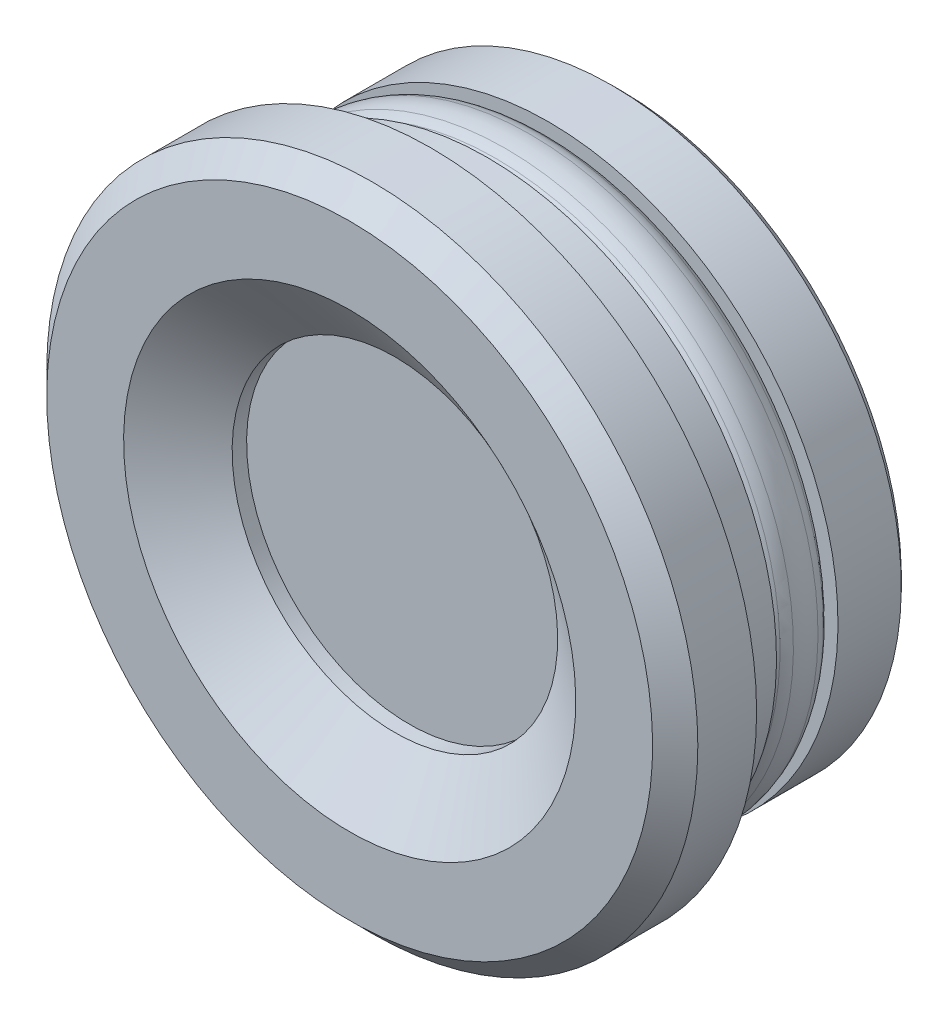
ISO-10303-21;
HEADER;
FILE_DESCRIPTION(('STEP AP214'),'2;1');
FILE_NAME('part.step','',(''),(''),'','','');
FILE_SCHEMA(('AUTOMOTIVE_DESIGN { 1 0 10303 214 1 1 1 1 }'));
ENDSEC;
DATA;
#1=APPLICATION_CONTEXT('core data for automotive mechanical design processes');
#2=APPLICATION_PROTOCOL_DEFINITION('international standard','automotive_design',2000,#1);
#3=PRODUCT_CONTEXT('',#1,'mechanical');
#4=PRODUCT('Part','Part','',(#3));
#5=PRODUCT_RELATED_PRODUCT_CATEGORY('part','',(#4));
#6=PRODUCT_DEFINITION_FORMATION('','',#4);
#7=PRODUCT_DEFINITION_CONTEXT('part definition',#1,'design');
#8=PRODUCT_DEFINITION('design','',#6,#7);
#9=PRODUCT_DEFINITION_SHAPE('','',#8);
#10=(LENGTH_UNIT() NAMED_UNIT(*) SI_UNIT(.MILLI.,.METRE.));
#11=(NAMED_UNIT(*) PLANE_ANGLE_UNIT() SI_UNIT($,.RADIAN.));
#12=(NAMED_UNIT(*) SI_UNIT($,.STERADIAN.) SOLID_ANGLE_UNIT());
#13=UNCERTAINTY_MEASURE_WITH_UNIT(LENGTH_MEASURE(1.E-05),#10,'distance_accuracy_value','');
#14=(GEOMETRIC_REPRESENTATION_CONTEXT(3) GLOBAL_UNCERTAINTY_ASSIGNED_CONTEXT((#13)) GLOBAL_UNIT_ASSIGNED_CONTEXT((#10,
#11,#12)) REPRESENTATION_CONTEXT('',''));
#15=CARTESIAN_POINT('',(0.,0.,0.));
#16=DIRECTION('',(0.,0.,1.));
#17=DIRECTION('',(1.,0.,0.));
#18=AXIS2_PLACEMENT_3D('',#15,#16,#17);
#19=CARTESIAN_POINT('',(0.,0.,-10.5000000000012));
#20=DIRECTION('',(0.,0.,-1.));
#21=DIRECTION('',(0.,1.,0.));
#22=AXIS2_PLACEMENT_3D('',#19,#20,#21);
#23=PLANE('',#22);
#24=CARTESIAN_POINT('',(0.,0.,-10.5000000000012));
#25=DIRECTION('',(0.,0.,-1.));
#26=DIRECTION('',(0.,1.,0.));
#27=AXIS2_PLACEMENT_3D('',#24,#25,#26);
#28=CIRCLE('',#27,15.5);
#29=CARTESIAN_POINT('',(0.,15.5,-10.5000000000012));
#30=VERTEX_POINT('',#29);
#31=EDGE_CURVE('E8',#30,#30,#28,.T.);
#32=ORIENTED_EDGE('',*,*,#31,.T.);
#33=EDGE_LOOP('',(#32));
#34=FACE_BOUND('',#33,.T.);
#35=ADVANCED_FACE('F12',(#34),#23,.T.);
#36=CARTESIAN_POINT('',(0.,0.,-10.5000000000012));
#37=DIRECTION('',(0.,0.,1.));
#38=DIRECTION('',(0.,-1.,0.));
#39=AXIS2_PLACEMENT_3D('',#36,#37,#38);
#40=CONICAL_SURFACE('',#39,15.5,0.785398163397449);
#41=CARTESIAN_POINT('',(0.,0.,-10.0000000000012));
#42=DIRECTION('',(0.,0.,-1.));
#43=DIRECTION('',(0.,1.,0.));
#44=AXIS2_PLACEMENT_3D('',#41,#42,#43);
#45=CIRCLE('',#44,16.);
#46=CARTESIAN_POINT('',(0.,16.,-10.0000000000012));
#47=VERTEX_POINT('',#46);
#48=EDGE_CURVE('E18',#47,#47,#45,.T.);
#49=ORIENTED_EDGE('',*,*,#48,.T.);
#50=EDGE_LOOP('',(#49));
#51=FACE_BOUND('',#50,.T.);
#52=ORIENTED_EDGE('',*,*,#31,.F.);
#53=EDGE_LOOP('',(#52));
#54=FACE_BOUND('',#53,.T.);
#55=ADVANCED_FACE('F91',(#51,#54),#40,.T.);
#56=CARTESIAN_POINT('',(0.,0.,-10.5000000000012));
#57=DIRECTION('',(0.,0.,-1.));
#58=DIRECTION('',(0.,1.,0.));
#59=AXIS2_PLACEMENT_3D('',#56,#57,#58);
#60=CYLINDRICAL_SURFACE('',#59,16.);
#61=CARTESIAN_POINT('',(0.,0.,-6.50000000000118));
#62=DIRECTION('',(0.,0.,-1.));
#63=DIRECTION('',(0.,1.,0.));
#64=AXIS2_PLACEMENT_3D('',#61,#62,#63);
#65=CIRCLE('',#64,16.);
#66=CARTESIAN_POINT('',(0.,16.,-6.50000000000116));
#67=VERTEX_POINT('',#66);
#68=EDGE_CURVE('E22',#67,#67,#65,.T.);
#69=ORIENTED_EDGE('',*,*,#68,.T.);
#70=EDGE_LOOP('',(#69));
#71=FACE_BOUND('',#70,.T.);
#72=ORIENTED_EDGE('',*,*,#48,.F.);
#73=EDGE_LOOP('',(#72));
#74=FACE_BOUND('',#73,.T.);
#75=ADVANCED_FACE('F96',(#71,#74),#60,.T.);
#76=CARTESIAN_POINT('',(0.,14.9500000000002,-6.50000000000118));
#77=DIRECTION('',(0.,0.,1.));
#78=DIRECTION('',(0.,-1.,0.));
#79=AXIS2_PLACEMENT_3D('',#76,#77,#78);
#80=PLANE('',#79);
#81=CARTESIAN_POINT('',(0.,0.,-6.50000000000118));
#82=DIRECTION('',(0.,0.,-1.));
#83=DIRECTION('',(0.,1.,0.));
#84=AXIS2_PLACEMENT_3D('',#81,#82,#83);
#85=CIRCLE('',#84,14.9500000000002);
#86=CARTESIAN_POINT('',(0.,14.9500000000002,-6.50000000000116));
#87=VERTEX_POINT('',#86);
#88=EDGE_CURVE('E26',#87,#87,#85,.T.);
#89=ORIENTED_EDGE('',*,*,#88,.T.);
#90=EDGE_LOOP('',(#89));
#91=FACE_BOUND('',#90,.T.);
#92=ORIENTED_EDGE('',*,*,#68,.F.);
#93=EDGE_LOOP('',(#92));
#94=FACE_BOUND('',#93,.T.);
#95=ADVANCED_FACE('F101',(#91,#94),#80,.T.);
#96=CARTESIAN_POINT('',(0.,0.,-5.83242233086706));
#97=DIRECTION('',(0.,0.,-1.));
#98=DIRECTION('',(0.,1.,0.));
#99=AXIS2_PLACEMENT_3D('',#96,#97,#98);
#100=TOROIDAL_SURFACE('',#99,14.9500000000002,0.667577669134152);
#101=CARTESIAN_POINT('',(0.,0.,-6.3868638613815));
#102=DIRECTION('',(0.,0.,-1.));
#103=DIRECTION('',(0.,1.,0.));
#104=AXIS2_PLACEMENT_3D('',#101,#102,#103);
#105=CIRCLE('',#104,15.3218259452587);
#106=CARTESIAN_POINT('',(0.,15.3218259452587,-6.38686386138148));
#107=VERTEX_POINT('',#106);
#108=EDGE_CURVE('E31',#107,#107,#105,.T.);
#109=ORIENTED_EDGE('',*,*,#108,.T.);
#110=EDGE_LOOP('',(#109));
#111=FACE_BOUND('',#110,.T.);
#112=ORIENTED_EDGE('',*,*,#88,.F.);
#113=EDGE_LOOP('',(#112));
#114=FACE_BOUND('',#113,.T.);
#115=ADVANCED_FACE('F108',(#111,#114),#100,.T.);
#116=CARTESIAN_POINT('',(0.,0.,-5.33920444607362));
#117=DIRECTION('',(0.,0.,-1.));
#118=DIRECTION('',(0.,1.,0.));
#119=AXIS2_PLACEMENT_3D('',#116,#117,#118);
#120=TOROIDAL_SURFACE('',#119,14.6192325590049,1.26143874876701);
#121=CARTESIAN_POINT('',(0.,0.,-6.00208152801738));
#122=DIRECTION('',(0.,0.,-1.));
#123=DIRECTION('',(0.,1.,0.));
#124=AXIS2_PLACEMENT_3D('',#121,#122,#123);
#125=CIRCLE('',#124,15.6924621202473);
#126=CARTESIAN_POINT('',(0.,15.6924621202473,-6.00208152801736));
#127=VERTEX_POINT('',#126);
#128=EDGE_CURVE('E34',#127,#127,#125,.T.);
#129=ORIENTED_EDGE('',*,*,#128,.T.);
#130=EDGE_LOOP('',(#129));
#131=FACE_BOUND('',#130,.T.);
#132=ORIENTED_EDGE('',*,*,#108,.F.);
#133=EDGE_LOOP('',(#132));
#134=FACE_BOUND('',#133,.T.);
#135=ADVANCED_FACE('F112',(#131,#134),#120,.T.);
#136=CARTESIAN_POINT('',(0.,0.,-5.013662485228));
#137=DIRECTION('',(0.,0.,-1.));
#138=DIRECTION('',(0.,1.,0.));
#139=AXIS2_PLACEMENT_3D('',#136,#137,#138);
#140=TOROIDAL_SURFACE('',#139,14.0921646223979,1.88093707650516);
#141=CARTESIAN_POINT('',(0.,0.,-5.47986199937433));
#142=DIRECTION('',(0.,0.,-1.));
#143=DIRECTION('',(0.,1.,0.));
#144=AXIS2_PLACEMENT_3D('',#141,#142,#143);
#145=CIRCLE('',#144,15.914411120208);
#146=CARTESIAN_POINT('',(0.,15.9144111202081,-5.47986199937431));
#147=VERTEX_POINT('',#146);
#148=EDGE_CURVE('E37',#147,#147,#145,.T.);
#149=ORIENTED_EDGE('',*,*,#148,.T.);
#150=EDGE_LOOP('',(#149));
#151=FACE_BOUND('',#150,.T.);
#152=ORIENTED_EDGE('',*,*,#128,.F.);
#153=EDGE_LOOP('',(#152));
#154=FACE_BOUND('',#153,.T.);
#155=ADVANCED_FACE('F116',(#151,#154),#140,.T.);
#156=CARTESIAN_POINT('',(0.,0.,-4.80000000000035));
#157=DIRECTION('',(0.,0.,-1.));
#158=DIRECTION('',(0.,1.,0.));
#159=AXIS2_PLACEMENT_3D('',#156,#157,#158);
#160=TOROIDAL_SURFACE('',#159,13.2570163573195,2.74298364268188);
#161=CARTESIAN_POINT('',(0.,0.,-4.12013800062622));
#162=DIRECTION('',(0.,0.,-1.));
#163=DIRECTION('',(0.,1.,0.));
#164=AXIS2_PLACEMENT_3D('',#161,#162,#163);
#165=CIRCLE('',#164,15.914411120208);
#166=CARTESIAN_POINT('',(0.,15.9144111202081,-4.1201380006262));
#167=VERTEX_POINT('',#166);
#168=EDGE_CURVE('E40',#167,#167,#165,.T.);
#169=ORIENTED_EDGE('',*,*,#168,.T.);
#170=EDGE_LOOP('',(#169));
#171=FACE_BOUND('',#170,.T.);
#172=ORIENTED_EDGE('',*,*,#148,.F.);
#173=EDGE_LOOP('',(#172));
#174=FACE_BOUND('',#173,.T.);
#175=ADVANCED_FACE('F120',(#171,#174),#160,.T.);
#176=CARTESIAN_POINT('',(0.,0.,-4.58633751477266));
#177=DIRECTION('',(0.,0.,-1.));
#178=DIRECTION('',(0.,1.,0.));
#179=AXIS2_PLACEMENT_3D('',#176,#177,#178);
#180=TOROIDAL_SURFACE('',#179,14.0921646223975,1.88093707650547);
#181=CARTESIAN_POINT('',(0.,0.,-3.59791847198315));
#182=DIRECTION('',(0.,0.,-1.));
#183=DIRECTION('',(0.,1.,0.));
#184=AXIS2_PLACEMENT_3D('',#181,#182,#183);
#185=CIRCLE('',#184,15.6924621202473);
#186=CARTESIAN_POINT('',(0.,15.6924621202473,-3.59791847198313));
#187=VERTEX_POINT('',#186);
#188=EDGE_CURVE('E43',#187,#187,#185,.T.);
#189=ORIENTED_EDGE('',*,*,#188,.T.);
#190=EDGE_LOOP('',(#189));
#191=FACE_BOUND('',#190,.T.);
#192=ORIENTED_EDGE('',*,*,#168,.F.);
#193=EDGE_LOOP('',(#192));
#194=FACE_BOUND('',#193,.T.);
#195=ADVANCED_FACE('F124',(#191,#194),#180,.T.);
#196=CARTESIAN_POINT('',(0.,0.,-4.26079555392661));
#197=DIRECTION('',(0.,0.,-1.));
#198=DIRECTION('',(0.,1.,0.));
#199=AXIS2_PLACEMENT_3D('',#196,#197,#198);
#200=TOROIDAL_SURFACE('',#199,14.6192325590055,1.26143874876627);
#201=CARTESIAN_POINT('',(0.,0.,-3.21313613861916));
#202=DIRECTION('',(0.,0.,-1.));
#203=DIRECTION('',(0.,1.,0.));
#204=AXIS2_PLACEMENT_3D('',#201,#202,#203);
#205=CIRCLE('',#204,15.3218259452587);
#206=CARTESIAN_POINT('',(0.,15.3218259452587,-3.21313613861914));
#207=VERTEX_POINT('',#206);
#208=EDGE_CURVE('E46',#207,#207,#205,.T.);
#209=ORIENTED_EDGE('',*,*,#208,.T.);
#210=EDGE_LOOP('',(#209));
#211=FACE_BOUND('',#210,.T.);
#212=ORIENTED_EDGE('',*,*,#188,.F.);
#213=EDGE_LOOP('',(#212));
#214=FACE_BOUND('',#213,.T.);
#215=ADVANCED_FACE('F128',(#211,#214),#200,.T.);
#216=CARTESIAN_POINT('',(0.,0.,-3.7675776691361));
#217=DIRECTION('',(0.,0.,-1.));
#218=DIRECTION('',(0.,1.,0.));
#219=AXIS2_PLACEMENT_3D('',#216,#217,#218);
#220=TOROIDAL_SURFACE('',#219,14.9500000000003,0.667577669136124);
#221=CARTESIAN_POINT('',(0.,0.,-3.1));
#222=DIRECTION('',(0.,0.,-1.));
#223=DIRECTION('',(0.,1.,0.));
#224=AXIS2_PLACEMENT_3D('',#221,#222,#223);
#225=CIRCLE('',#224,14.9500000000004);
#226=CARTESIAN_POINT('',(0.,14.9500000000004,-3.09999999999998));
#227=VERTEX_POINT('',#226);
#228=EDGE_CURVE('E49',#227,#227,#225,.T.);
#229=ORIENTED_EDGE('',*,*,#228,.T.);
#230=EDGE_LOOP('',(#229));
#231=FACE_BOUND('',#230,.T.);
#232=ORIENTED_EDGE('',*,*,#208,.F.);
#233=EDGE_LOOP('',(#232));
#234=FACE_BOUND('',#233,.T.);
#235=ADVANCED_FACE('F132',(#231,#234),#220,.T.);
#236=CARTESIAN_POINT('',(0.,14.9500000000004,-3.09999999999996));
#237=DIRECTION('',(0.,0.,-1.));
#238=DIRECTION('',(0.,1.,0.));
#239=AXIS2_PLACEMENT_3D('',#236,#237,#238);
#240=PLANE('',#239);
#241=CARTESIAN_POINT('',(0.,0.,-3.1));
#242=DIRECTION('',(0.,0.,-1.));
#243=DIRECTION('',(0.,1.,0.));
#244=AXIS2_PLACEMENT_3D('',#241,#242,#243);
#245=CIRCLE('',#244,16.0000000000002);
#246=CARTESIAN_POINT('',(0.,16.0000000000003,-3.09999999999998));
#247=VERTEX_POINT('',#246);
#248=EDGE_CURVE('E52',#247,#247,#245,.T.);
#249=ORIENTED_EDGE('',*,*,#248,.T.);
#250=EDGE_LOOP('',(#249));
#251=FACE_BOUND('',#250,.T.);
#252=ORIENTED_EDGE('',*,*,#228,.F.);
#253=EDGE_LOOP('',(#252));
#254=FACE_BOUND('',#253,.T.);
#255=ADVANCED_FACE('F136',(#251,#254),#240,.T.);
#256=CARTESIAN_POINT('',(0.,0.,-10.5000000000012));
#257=DIRECTION('',(0.,0.,-1.));
#258=DIRECTION('',(0.,1.,0.));
#259=AXIS2_PLACEMENT_3D('',#256,#257,#258);
#260=CYLINDRICAL_SURFACE('',#259,16.0000000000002);
#261=CARTESIAN_POINT('',(0.,0.,0.));
#262=DIRECTION('',(0.,0.,-1.));
#263=DIRECTION('',(0.,1.,0.));
#264=AXIS2_PLACEMENT_3D('',#261,#262,#263);
#265=CIRCLE('',#264,16.0000000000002);
#266=CARTESIAN_POINT('',(0.,16.0000000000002,0.));
#267=VERTEX_POINT('',#266);
#268=EDGE_CURVE('E55',#267,#267,#265,.T.);
#269=ORIENTED_EDGE('',*,*,#268,.T.);
#270=EDGE_LOOP('',(#269));
#271=FACE_BOUND('',#270,.T.);
#272=ORIENTED_EDGE('',*,*,#248,.F.);
#273=EDGE_LOOP('',(#272));
#274=FACE_BOUND('',#273,.T.);
#275=ADVANCED_FACE('F140',(#271,#274),#260,.T.);
#276=CARTESIAN_POINT('',(0.,16.,0.));
#277=DIRECTION('',(0.,0.,-1.));
#278=DIRECTION('',(0.,1.,0.));
#279=AXIS2_PLACEMENT_3D('',#276,#277,#278);
#280=PLANE('',#279);
#281=CARTESIAN_POINT('',(0.,0.,0.));
#282=DIRECTION('',(0.,0.,-1.));
#283=DIRECTION('',(0.,1.,0.));
#284=AXIS2_PLACEMENT_3D('',#281,#282,#283);
#285=CIRCLE('',#284,18.);
#286=CARTESIAN_POINT('',(0.,18.,0.));
#287=VERTEX_POINT('',#286);
#288=EDGE_CURVE('E58',#287,#287,#285,.T.);
#289=ORIENTED_EDGE('',*,*,#288,.T.);
#290=EDGE_LOOP('',(#289));
#291=FACE_BOUND('',#290,.T.);
#292=ORIENTED_EDGE('',*,*,#268,.F.);
#293=EDGE_LOOP('',(#292));
#294=FACE_BOUND('',#293,.T.);
#295=ADVANCED_FACE('F144',(#291,#294),#280,.T.);
#296=CARTESIAN_POINT('',(0.,0.,-10.5000000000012));
#297=DIRECTION('',(0.,0.,-1.));
#298=DIRECTION('',(0.,1.,0.));
#299=AXIS2_PLACEMENT_3D('',#296,#297,#298);
#300=CYLINDRICAL_SURFACE('',#299,18.);
#301=CARTESIAN_POINT('',(0.,0.,3.25));
#302=DIRECTION('',(0.,0.,-1.));
#303=DIRECTION('',(0.,1.,0.));
#304=AXIS2_PLACEMENT_3D('',#301,#302,#303);
#305=CIRCLE('',#304,18.);
#306=CARTESIAN_POINT('',(0.,18.,3.25000000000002));
#307=VERTEX_POINT('',#306);
#308=EDGE_CURVE('E61',#307,#307,#305,.T.);
#309=ORIENTED_EDGE('',*,*,#308,.T.);
#310=EDGE_LOOP('',(#309));
#311=FACE_BOUND('',#310,.T.);
#312=ORIENTED_EDGE('',*,*,#288,.F.);
#313=EDGE_LOOP('',(#312));
#314=FACE_BOUND('',#313,.T.);
#315=ADVANCED_FACE('F148',(#311,#314),#300,.T.);
#316=CARTESIAN_POINT('',(0.,0.,3.25));
#317=DIRECTION('',(0.,0.,-1.));
#318=DIRECTION('',(0.,1.,0.));
#319=AXIS2_PLACEMENT_3D('',#316,#317,#318);
#320=CONICAL_SURFACE('',#319,18.,0.785398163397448);
#321=CARTESIAN_POINT('',(0.,0.,4.5));
#322=DIRECTION('',(0.,0.,-1.));
#323=DIRECTION('',(0.,1.,0.));
#324=AXIS2_PLACEMENT_3D('',#321,#322,#323);
#325=CIRCLE('',#324,16.75);
#326=CARTESIAN_POINT('',(0.,16.75,4.50000000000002));
#327=VERTEX_POINT('',#326);
#328=EDGE_CURVE('E64',#327,#327,#325,.T.);
#329=ORIENTED_EDGE('',*,*,#328,.T.);
#330=EDGE_LOOP('',(#329));
#331=FACE_BOUND('',#330,.T.);
#332=ORIENTED_EDGE('',*,*,#308,.F.);
#333=EDGE_LOOP('',(#332));
#334=FACE_BOUND('',#333,.T.);
#335=ADVANCED_FACE('F152',(#331,#334),#320,.T.);
#336=CARTESIAN_POINT('',(0.,12.5,4.5));
#337=DIRECTION('',(0.,0.,1.));
#338=DIRECTION('',(0.,-1.,0.));
#339=AXIS2_PLACEMENT_3D('',#336,#337,#338);
#340=PLANE('',#339);
#341=CARTESIAN_POINT('',(0.,0.,4.5));
#342=DIRECTION('',(0.,0.,-1.));
#343=DIRECTION('',(0.,1.,0.));
#344=AXIS2_PLACEMENT_3D('',#341,#342,#343);
#345=CIRCLE('',#344,12.5);
#346=CARTESIAN_POINT('',(0.,12.5,4.50000000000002));
#347=VERTEX_POINT('',#346);
#348=EDGE_CURVE('E67',#347,#347,#345,.T.);
#349=ORIENTED_EDGE('',*,*,#348,.T.);
#350=EDGE_LOOP('',(#349));
#351=FACE_BOUND('',#350,.T.);
#352=ORIENTED_EDGE('',*,*,#328,.F.);
#353=EDGE_LOOP('',(#352));
#354=FACE_BOUND('',#353,.T.);
#355=ADVANCED_FACE('F156',(#351,#354),#340,.T.);
#356=CARTESIAN_POINT('',(0.,0.,4.5));
#357=DIRECTION('',(0.,0.,1.));
#358=DIRECTION('',(0.,-1.,0.));
#359=AXIS2_PLACEMENT_3D('',#356,#357,#358);
#360=CONICAL_SURFACE('',#359,12.5,0.950546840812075);
#361=CARTESIAN_POINT('',(0.,0.,2.));
#362=DIRECTION('',(0.,0.,-1.));
#363=DIRECTION('',(0.,1.,0.));
#364=AXIS2_PLACEMENT_3D('',#361,#362,#363);
#365=CIRCLE('',#364,9.);
#366=CARTESIAN_POINT('',(0.,9.,2.00000000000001));
#367=VERTEX_POINT('',#366);
#368=EDGE_CURVE('E70',#367,#367,#365,.T.);
#369=ORIENTED_EDGE('',*,*,#368,.T.);
#370=EDGE_LOOP('',(#369));
#371=FACE_BOUND('',#370,.T.);
#372=ORIENTED_EDGE('',*,*,#348,.F.);
#373=EDGE_LOOP('',(#372));
#374=FACE_BOUND('',#373,.T.);
#375=ADVANCED_FACE('F88',(#371,#374),#360,.F.);
#376=CARTESIAN_POINT('',(0.,0.,-10.5000000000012));
#377=DIRECTION('',(0.,0.,-1.));
#378=DIRECTION('',(0.,1.,0.));
#379=AXIS2_PLACEMENT_3D('',#376,#377,#378);
#380=CYLINDRICAL_SURFACE('',#379,9.);
#381=CARTESIAN_POINT('',(0.,0.,1.2));
#382=DIRECTION('',(0.,0.,-1.));
#383=DIRECTION('',(0.,1.,0.));
#384=AXIS2_PLACEMENT_3D('',#381,#382,#383);
#385=CIRCLE('',#384,9.);
#386=CARTESIAN_POINT('',(0.,9.,1.20000000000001));
#387=VERTEX_POINT('',#386);
#388=EDGE_CURVE('E73',#387,#387,#385,.T.);
#389=ORIENTED_EDGE('',*,*,#388,.T.);
#390=EDGE_LOOP('',(#389));
#391=FACE_BOUND('',#390,.T.);
#392=ORIENTED_EDGE('',*,*,#368,.F.);
#393=EDGE_LOOP('',(#392));
#394=FACE_BOUND('',#393,.T.);
#395=ADVANCED_FACE('F77',(#391,#394),#380,.F.);
#396=CARTESIAN_POINT('',(0.,0.,1.20000000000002));
#397=DIRECTION('',(0.,0.,1.));
#398=DIRECTION('',(0.,-1.,0.));
#399=AXIS2_PLACEMENT_3D('',#396,#397,#398);
#400=PLANE('',#399);
#401=ORIENTED_EDGE('',*,*,#388,.F.);
#402=EDGE_LOOP('',(#401));
#403=FACE_BOUND('',#402,.T.);
#404=ADVANCED_FACE('F80',(#403),#400,.T.);
#405=CLOSED_SHELL('',(#35,#55,#75,#95,#115,#135,#155,#175,#195,#215,#235,#255,#275,#295,#315,
#335,#355,#375,#395,#404));
#406=MANIFOLD_SOLID_BREP('B1',#405);
#407=ADVANCED_BREP_SHAPE_REPRESENTATION('',(#18,#406),#14);
#408=SHAPE_DEFINITION_REPRESENTATION(#9,#407);
ENDSEC;
END-ISO-10303-21;
